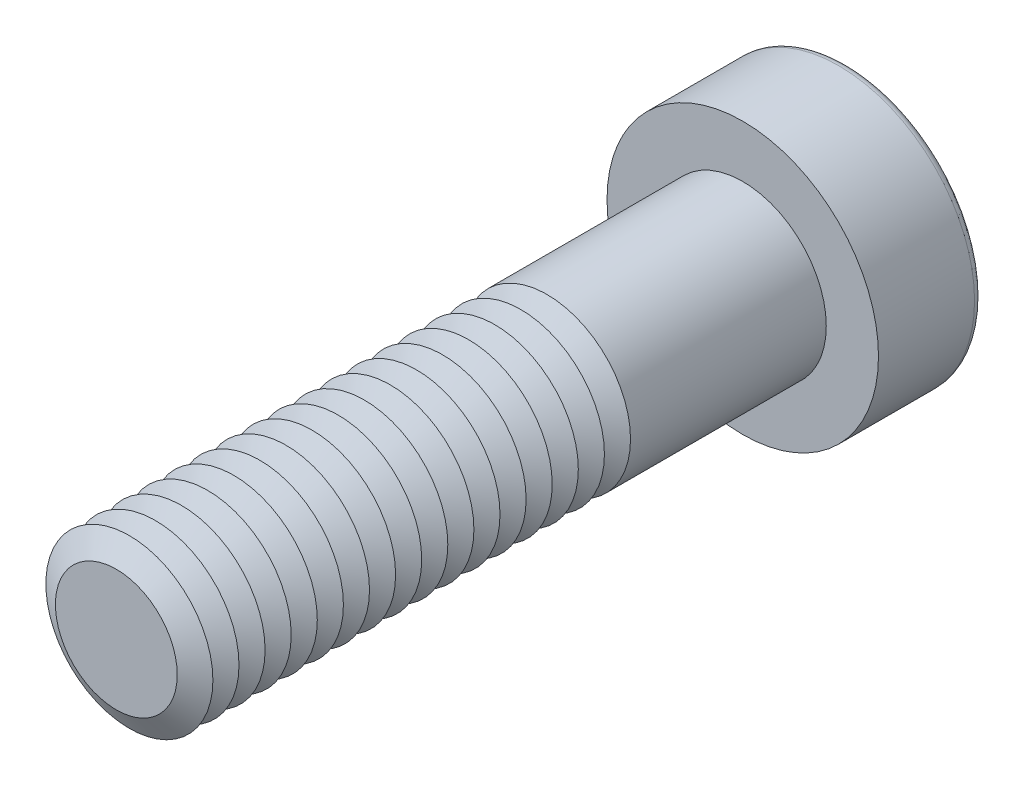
ISO-10303-21;
HEADER;
FILE_DESCRIPTION(('STEP AP214'),'2;1');
FILE_NAME('part.step','',(''),(''),'','','');
FILE_SCHEMA(('AUTOMOTIVE_DESIGN { 1 0 10303 214 1 1 1 1 }'));
ENDSEC;
DATA;
#1=APPLICATION_CONTEXT('core data for automotive mechanical design processes');
#2=APPLICATION_PROTOCOL_DEFINITION('international standard','automotive_design',2000,#1);
#3=PRODUCT_CONTEXT('',#1,'mechanical');
#4=PRODUCT('Part','Part','',(#3));
#5=PRODUCT_RELATED_PRODUCT_CATEGORY('part','',(#4));
#6=PRODUCT_DEFINITION_FORMATION('','',#4);
#7=PRODUCT_DEFINITION_CONTEXT('part definition',#1,'design');
#8=PRODUCT_DEFINITION('design','',#6,#7);
#9=PRODUCT_DEFINITION_SHAPE('','',#8);
#10=(LENGTH_UNIT() NAMED_UNIT(*) SI_UNIT(.MILLI.,.METRE.));
#11=(NAMED_UNIT(*) PLANE_ANGLE_UNIT() SI_UNIT($,.RADIAN.));
#12=(NAMED_UNIT(*) SI_UNIT($,.STERADIAN.) SOLID_ANGLE_UNIT());
#13=UNCERTAINTY_MEASURE_WITH_UNIT(LENGTH_MEASURE(1.E-05),#10,'distance_accuracy_value','');
#14=(GEOMETRIC_REPRESENTATION_CONTEXT(3) GLOBAL_UNCERTAINTY_ASSIGNED_CONTEXT((#13)) GLOBAL_UNIT_ASSIGNED_CONTEXT((#10,
#11,#12)) REPRESENTATION_CONTEXT('',''));
#15=CARTESIAN_POINT('',(0.,0.,0.));
#16=DIRECTION('',(0.,0.,1.));
#17=DIRECTION('',(1.,0.,0.));
#18=AXIS2_PLACEMENT_3D('',#15,#16,#17);
#19=CARTESIAN_POINT('',(0.,0.,25.625));
#20=DIRECTION('',(0.,0.,1.));
#21=DIRECTION('',(1.,0.,0.));
#22=AXIS2_PLACEMENT_3D('',#19,#20,#21);
#23=CONICAL_SURFACE('',#22,4.,1.0471975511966);
#24=CARTESIAN_POINT('',(0.,0.,25.));
#25=DIRECTION('',(0.,0.,1.));
#26=DIRECTION('',(1.,0.,0.));
#27=AXIS2_PLACEMENT_3D('',#24,#25,#26);
#28=CIRCLE('',#27,2.91746824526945);
#29=CARTESIAN_POINT('',(2.91746824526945,0.,25.));
#30=VERTEX_POINT('',#29);
#31=EDGE_CURVE('E312',#30,#30,#28,.T.);
#32=ORIENTED_EDGE('',*,*,#31,.T.);
#33=EDGE_LOOP('',(#32));
#34=FACE_BOUND('',#33,.T.);
#35=CARTESIAN_POINT('',(0.,0.,25.625));
#36=DIRECTION('',(0.,0.,1.));
#37=DIRECTION('',(1.,0.,0.));
#38=AXIS2_PLACEMENT_3D('',#35,#36,#37);
#39=CIRCLE('',#38,4.);
#40=CARTESIAN_POINT('',(4.,0.,25.625));
#41=VERTEX_POINT('',#40);
#42=EDGE_CURVE('E315',#41,#41,#39,.T.);
#43=ORIENTED_EDGE('',*,*,#42,.F.);
#44=EDGE_LOOP('',(#43));
#45=FACE_BOUND('',#44,.T.);
#46=ADVANCED_FACE('F39',(#34,#45),#23,.T.);
#47=CARTESIAN_POINT('',(0.,0.,25.));
#48=DIRECTION('',(0.,0.,-1.));
#49=DIRECTION('',(-1.,0.,0.));
#50=AXIS2_PLACEMENT_3D('',#47,#48,#49);
#51=CONICAL_SURFACE('',#50,2.91746824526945,1.0471975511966);
#52=CARTESIAN_POINT('',(0.,0.,24.375));
#53=DIRECTION('',(0.,0.,1.));
#54=DIRECTION('',(1.,0.,0.));
#55=AXIS2_PLACEMENT_3D('',#52,#53,#54);
#56=CIRCLE('',#55,4.);
#57=CARTESIAN_POINT('',(4.,0.,24.375));
#58=VERTEX_POINT('',#57);
#59=EDGE_CURVE('E323',#58,#58,#56,.T.);
#60=ORIENTED_EDGE('',*,*,#59,.T.);
#61=EDGE_LOOP('',(#60));
#62=FACE_BOUND('',#61,.T.);
#63=ORIENTED_EDGE('',*,*,#31,.F.);
#64=EDGE_LOOP('',(#63));
#65=FACE_BOUND('',#64,.T.);
#66=ADVANCED_FACE('F245',(#62,#65),#51,.T.);
#67=CARTESIAN_POINT('',(0.,0.,30.));
#68=DIRECTION('',(0.,0.,1.));
#69=DIRECTION('',(1.,0.,0.));
#70=AXIS2_PLACEMENT_3D('',#67,#68,#69);
#71=PLANE('',#70);
#72=CARTESIAN_POINT('',(0.,0.,30.));
#73=DIRECTION('',(0.,0.,1.));
#74=DIRECTION('',(1.,0.,0.));
#75=AXIS2_PLACEMENT_3D('',#72,#73,#74);
#76=CIRCLE('',#75,2.91746824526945);
#77=CARTESIAN_POINT('',(2.91746824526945,0.,30.));
#78=VERTEX_POINT('',#77);
#79=EDGE_CURVE('E174',#78,#78,#76,.T.);
#80=ORIENTED_EDGE('',*,*,#79,.T.);
#81=EDGE_LOOP('',(#80));
#82=FACE_BOUND('',#81,.T.);
#83=ADVANCED_FACE('F251',(#82),#71,.T.);
#84=CARTESIAN_POINT('',(0.,0.,30.));
#85=DIRECTION('',(0.,0.,-1.));
#86=DIRECTION('',(-1.,0.,0.));
#87=AXIS2_PLACEMENT_3D('',#84,#85,#86);
#88=CONICAL_SURFACE('',#87,2.91746824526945,1.0471975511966);
#89=CARTESIAN_POINT('',(0.,0.,29.375));
#90=DIRECTION('',(0.,0.,1.));
#91=DIRECTION('',(1.,0.,0.));
#92=AXIS2_PLACEMENT_3D('',#89,#90,#91);
#93=CIRCLE('',#92,4.);
#94=CARTESIAN_POINT('',(4.,0.,29.375));
#95=VERTEX_POINT('',#94);
#96=EDGE_CURVE('E291',#95,#95,#93,.T.);
#97=ORIENTED_EDGE('',*,*,#96,.T.);
#98=EDGE_LOOP('',(#97));
#99=FACE_BOUND('',#98,.T.);
#100=ORIENTED_EDGE('',*,*,#79,.F.);
#101=EDGE_LOOP('',(#100));
#102=FACE_BOUND('',#101,.T.);
#103=ADVANCED_FACE('F199',(#99,#102),#88,.T.);
#104=CARTESIAN_POINT('',(0.,0.,29.375));
#105=DIRECTION('',(0.,0.,1.));
#106=DIRECTION('',(1.,0.,0.));
#107=AXIS2_PLACEMENT_3D('',#104,#105,#106);
#108=CONICAL_SURFACE('',#107,4.,1.0471975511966);
#109=CARTESIAN_POINT('',(0.,0.,28.75));
#110=DIRECTION('',(0.,0.,1.));
#111=DIRECTION('',(1.,0.,0.));
#112=AXIS2_PLACEMENT_3D('',#109,#110,#111);
#113=CIRCLE('',#112,2.91746824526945);
#114=CARTESIAN_POINT('',(2.91746824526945,0.,28.75));
#115=VERTEX_POINT('',#114);
#116=EDGE_CURVE('E288',#115,#115,#113,.T.);
#117=ORIENTED_EDGE('',*,*,#116,.T.);
#118=EDGE_LOOP('',(#117));
#119=FACE_BOUND('',#118,.T.);
#120=ORIENTED_EDGE('',*,*,#96,.F.);
#121=EDGE_LOOP('',(#120));
#122=FACE_BOUND('',#121,.T.);
#123=ADVANCED_FACE('F277',(#119,#122),#108,.T.);
#124=CARTESIAN_POINT('',(0.,0.,28.75));
#125=DIRECTION('',(0.,0.,-1.));
#126=DIRECTION('',(-1.,0.,0.));
#127=AXIS2_PLACEMENT_3D('',#124,#125,#126);
#128=CONICAL_SURFACE('',#127,2.91746824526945,1.0471975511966);
#129=CARTESIAN_POINT('',(0.,0.,28.125));
#130=DIRECTION('',(0.,0.,1.));
#131=DIRECTION('',(1.,0.,0.));
#132=AXIS2_PLACEMENT_3D('',#129,#130,#131);
#133=CIRCLE('',#132,4.);
#134=CARTESIAN_POINT('',(4.,0.,28.125));
#135=VERTEX_POINT('',#134);
#136=EDGE_CURVE('E299',#135,#135,#133,.T.);
#137=ORIENTED_EDGE('',*,*,#136,.T.);
#138=EDGE_LOOP('',(#137));
#139=FACE_BOUND('',#138,.T.);
#140=ORIENTED_EDGE('',*,*,#116,.F.);
#141=EDGE_LOOP('',(#140));
#142=FACE_BOUND('',#141,.T.);
#143=ADVANCED_FACE('F274',(#139,#142),#128,.T.);
#144=CARTESIAN_POINT('',(0.,0.,28.125));
#145=DIRECTION('',(0.,0.,1.));
#146=DIRECTION('',(1.,0.,0.));
#147=AXIS2_PLACEMENT_3D('',#144,#145,#146);
#148=CONICAL_SURFACE('',#147,4.,1.0471975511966);
#149=CARTESIAN_POINT('',(0.,0.,27.5));
#150=DIRECTION('',(0.,0.,1.));
#151=DIRECTION('',(1.,0.,0.));
#152=AXIS2_PLACEMENT_3D('',#149,#150,#151);
#153=CIRCLE('',#152,2.91746824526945);
#154=CARTESIAN_POINT('',(2.91746824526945,0.,27.5));
#155=VERTEX_POINT('',#154);
#156=EDGE_CURVE('E293',#155,#155,#153,.T.);
#157=ORIENTED_EDGE('',*,*,#156,.T.);
#158=EDGE_LOOP('',(#157));
#159=FACE_BOUND('',#158,.T.);
#160=ORIENTED_EDGE('',*,*,#136,.F.);
#161=EDGE_LOOP('',(#160));
#162=FACE_BOUND('',#161,.T.);
#163=ADVANCED_FACE('F270',(#159,#162),#148,.T.);
#164=CARTESIAN_POINT('',(0.,0.,27.5));
#165=DIRECTION('',(0.,0.,-1.));
#166=DIRECTION('',(-1.,0.,0.));
#167=AXIS2_PLACEMENT_3D('',#164,#165,#166);
#168=CONICAL_SURFACE('',#167,2.91746824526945,1.0471975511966);
#169=CARTESIAN_POINT('',(0.,0.,26.875));
#170=DIRECTION('',(0.,0.,1.));
#171=DIRECTION('',(1.,0.,0.));
#172=AXIS2_PLACEMENT_3D('',#169,#170,#171);
#173=CIRCLE('',#172,4.);
#174=CARTESIAN_POINT('',(4.,0.,26.875));
#175=VERTEX_POINT('',#174);
#176=EDGE_CURVE('E309',#175,#175,#173,.T.);
#177=ORIENTED_EDGE('',*,*,#176,.T.);
#178=EDGE_LOOP('',(#177));
#179=FACE_BOUND('',#178,.T.);
#180=ORIENTED_EDGE('',*,*,#156,.F.);
#181=EDGE_LOOP('',(#180));
#182=FACE_BOUND('',#181,.T.);
#183=ADVANCED_FACE('F266',(#179,#182),#168,.T.);
#184=CARTESIAN_POINT('',(0.,0.,26.875));
#185=DIRECTION('',(0.,0.,1.));
#186=DIRECTION('',(1.,0.,0.));
#187=AXIS2_PLACEMENT_3D('',#184,#185,#186);
#188=CONICAL_SURFACE('',#187,4.,1.0471975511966);
#189=CARTESIAN_POINT('',(0.,0.,26.25));
#190=DIRECTION('',(0.,0.,1.));
#191=DIRECTION('',(1.,0.,0.));
#192=AXIS2_PLACEMENT_3D('',#189,#190,#191);
#193=CIRCLE('',#192,2.91746824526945);
#194=CARTESIAN_POINT('',(2.91746824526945,0.,26.25));
#195=VERTEX_POINT('',#194);
#196=EDGE_CURVE('E305',#195,#195,#193,.T.);
#197=ORIENTED_EDGE('',*,*,#196,.T.);
#198=EDGE_LOOP('',(#197));
#199=FACE_BOUND('',#198,.T.);
#200=ORIENTED_EDGE('',*,*,#176,.F.);
#201=EDGE_LOOP('',(#200));
#202=FACE_BOUND('',#201,.T.);
#203=ADVANCED_FACE('F262',(#199,#202),#188,.T.);
#204=CARTESIAN_POINT('',(0.,0.,26.25));
#205=DIRECTION('',(0.,0.,-1.));
#206=DIRECTION('',(-1.,0.,0.));
#207=AXIS2_PLACEMENT_3D('',#204,#205,#206);
#208=CONICAL_SURFACE('',#207,2.91746824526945,1.0471975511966);
#209=ORIENTED_EDGE('',*,*,#42,.T.);
#210=EDGE_LOOP('',(#209));
#211=FACE_BOUND('',#210,.T.);
#212=ORIENTED_EDGE('',*,*,#196,.F.);
#213=EDGE_LOOP('',(#212));
#214=FACE_BOUND('',#213,.T.);
#215=ADVANCED_FACE('F258',(#211,#214),#208,.T.);
#216=CARTESIAN_POINT('',(0.,0.,24.375));
#217=DIRECTION('',(0.,0.,1.));
#218=DIRECTION('',(1.,0.,0.));
#219=AXIS2_PLACEMENT_3D('',#216,#217,#218);
#220=CONICAL_SURFACE('',#219,4.,1.0471975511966);
#221=CARTESIAN_POINT('',(0.,0.,23.75));
#222=DIRECTION('',(0.,0.,1.));
#223=DIRECTION('',(1.,0.,0.));
#224=AXIS2_PLACEMENT_3D('',#221,#222,#223);
#225=CIRCLE('',#224,2.91746824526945);
#226=CARTESIAN_POINT('',(2.91746824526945,0.,23.75));
#227=VERTEX_POINT('',#226);
#228=EDGE_CURVE('E319',#227,#227,#225,.T.);
#229=ORIENTED_EDGE('',*,*,#228,.T.);
#230=EDGE_LOOP('',(#229));
#231=FACE_BOUND('',#230,.T.);
#232=ORIENTED_EDGE('',*,*,#59,.F.);
#233=EDGE_LOOP('',(#232));
#234=FACE_BOUND('',#233,.T.);
#235=ADVANCED_FACE('F261',(#231,#234),#220,.T.);
#236=CARTESIAN_POINT('',(0.,0.,23.75));
#237=DIRECTION('',(0.,0.,-1.));
#238=DIRECTION('',(-1.,0.,0.));
#239=AXIS2_PLACEMENT_3D('',#236,#237,#238);
#240=CONICAL_SURFACE('',#239,2.91746824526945,1.0471975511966);
#241=CARTESIAN_POINT('',(0.,0.,23.125));
#242=DIRECTION('',(0.,0.,1.));
#243=DIRECTION('',(1.,0.,0.));
#244=AXIS2_PLACEMENT_3D('',#241,#242,#243);
#245=CIRCLE('',#244,4.);
#246=CARTESIAN_POINT('',(4.,0.,23.125));
#247=VERTEX_POINT('',#246);
#248=EDGE_CURVE('E331',#247,#247,#245,.T.);
#249=ORIENTED_EDGE('',*,*,#248,.T.);
#250=EDGE_LOOP('',(#249));
#251=FACE_BOUND('',#250,.T.);
#252=ORIENTED_EDGE('',*,*,#228,.F.);
#253=EDGE_LOOP('',(#252));
#254=FACE_BOUND('',#253,.T.);
#255=ADVANCED_FACE('F511',(#251,#254),#240,.T.);
#256=CARTESIAN_POINT('',(0.,0.,23.125));
#257=DIRECTION('',(0.,0.,1.));
#258=DIRECTION('',(1.,0.,0.));
#259=AXIS2_PLACEMENT_3D('',#256,#257,#258);
#260=CONICAL_SURFACE('',#259,4.,1.0471975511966);
#261=CARTESIAN_POINT('',(0.,0.,22.5));
#262=DIRECTION('',(0.,0.,1.));
#263=DIRECTION('',(1.,0.,0.));
#264=AXIS2_PLACEMENT_3D('',#261,#262,#263);
#265=CIRCLE('',#264,2.91746824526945);
#266=CARTESIAN_POINT('',(2.91746824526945,0.,22.5));
#267=VERTEX_POINT('',#266);
#268=EDGE_CURVE('E327',#267,#267,#265,.T.);
#269=ORIENTED_EDGE('',*,*,#268,.T.);
#270=EDGE_LOOP('',(#269));
#271=FACE_BOUND('',#270,.T.);
#272=ORIENTED_EDGE('',*,*,#248,.F.);
#273=EDGE_LOOP('',(#272));
#274=FACE_BOUND('',#273,.T.);
#275=ADVANCED_FACE('F507',(#271,#274),#260,.T.);
#276=CARTESIAN_POINT('',(0.,0.,22.5));
#277=DIRECTION('',(0.,0.,-1.));
#278=DIRECTION('',(-1.,0.,0.));
#279=AXIS2_PLACEMENT_3D('',#276,#277,#278);
#280=CONICAL_SURFACE('',#279,2.91746824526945,1.0471975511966);
#281=CARTESIAN_POINT('',(0.,0.,21.875));
#282=DIRECTION('',(0.,0.,1.));
#283=DIRECTION('',(1.,0.,0.));
#284=AXIS2_PLACEMENT_3D('',#281,#282,#283);
#285=CIRCLE('',#284,4.);
#286=CARTESIAN_POINT('',(4.,0.,21.875));
#287=VERTEX_POINT('',#286);
#288=EDGE_CURVE('E339',#287,#287,#285,.T.);
#289=ORIENTED_EDGE('',*,*,#288,.T.);
#290=EDGE_LOOP('',(#289));
#291=FACE_BOUND('',#290,.T.);
#292=ORIENTED_EDGE('',*,*,#268,.F.);
#293=EDGE_LOOP('',(#292));
#294=FACE_BOUND('',#293,.T.);
#295=ADVANCED_FACE('F503',(#291,#294),#280,.T.);
#296=CARTESIAN_POINT('',(0.,0.,21.875));
#297=DIRECTION('',(0.,0.,1.));
#298=DIRECTION('',(1.,0.,0.));
#299=AXIS2_PLACEMENT_3D('',#296,#297,#298);
#300=CONICAL_SURFACE('',#299,4.,1.0471975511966);
#301=CARTESIAN_POINT('',(0.,0.,21.25));
#302=DIRECTION('',(0.,0.,1.));
#303=DIRECTION('',(1.,0.,0.));
#304=AXIS2_PLACEMENT_3D('',#301,#302,#303);
#305=CIRCLE('',#304,2.91746824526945);
#306=CARTESIAN_POINT('',(2.91746824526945,0.,21.25));
#307=VERTEX_POINT('',#306);
#308=EDGE_CURVE('E335',#307,#307,#305,.T.);
#309=ORIENTED_EDGE('',*,*,#308,.T.);
#310=EDGE_LOOP('',(#309));
#311=FACE_BOUND('',#310,.T.);
#312=ORIENTED_EDGE('',*,*,#288,.F.);
#313=EDGE_LOOP('',(#312));
#314=FACE_BOUND('',#313,.T.);
#315=ADVANCED_FACE('F499',(#311,#314),#300,.T.);
#316=CARTESIAN_POINT('',(0.,0.,21.25));
#317=DIRECTION('',(0.,0.,-1.));
#318=DIRECTION('',(-1.,0.,0.));
#319=AXIS2_PLACEMENT_3D('',#316,#317,#318);
#320=CONICAL_SURFACE('',#319,2.91746824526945,1.0471975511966);
#321=CARTESIAN_POINT('',(0.,0.,20.625));
#322=DIRECTION('',(0.,0.,1.));
#323=DIRECTION('',(1.,0.,0.));
#324=AXIS2_PLACEMENT_3D('',#321,#322,#323);
#325=CIRCLE('',#324,4.);
#326=CARTESIAN_POINT('',(4.,0.,20.625));
#327=VERTEX_POINT('',#326);
#328=EDGE_CURVE('E347',#327,#327,#325,.T.);
#329=ORIENTED_EDGE('',*,*,#328,.T.);
#330=EDGE_LOOP('',(#329));
#331=FACE_BOUND('',#330,.T.);
#332=ORIENTED_EDGE('',*,*,#308,.F.);
#333=EDGE_LOOP('',(#332));
#334=FACE_BOUND('',#333,.T.);
#335=ADVANCED_FACE('F495',(#331,#334),#320,.T.);
#336=CARTESIAN_POINT('',(0.,0.,20.625));
#337=DIRECTION('',(0.,0.,1.));
#338=DIRECTION('',(1.,0.,0.));
#339=AXIS2_PLACEMENT_3D('',#336,#337,#338);
#340=CONICAL_SURFACE('',#339,4.,1.0471975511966);
#341=CARTESIAN_POINT('',(0.,0.,20.));
#342=DIRECTION('',(0.,0.,1.));
#343=DIRECTION('',(1.,0.,0.));
#344=AXIS2_PLACEMENT_3D('',#341,#342,#343);
#345=CIRCLE('',#344,2.91746824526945);
#346=CARTESIAN_POINT('',(2.91746824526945,0.,20.));
#347=VERTEX_POINT('',#346);
#348=EDGE_CURVE('E343',#347,#347,#345,.T.);
#349=ORIENTED_EDGE('',*,*,#348,.T.);
#350=EDGE_LOOP('',(#349));
#351=FACE_BOUND('',#350,.T.);
#352=ORIENTED_EDGE('',*,*,#328,.F.);
#353=EDGE_LOOP('',(#352));
#354=FACE_BOUND('',#353,.T.);
#355=ADVANCED_FACE('F491',(#351,#354),#340,.T.);
#356=CARTESIAN_POINT('',(0.,0.,20.));
#357=DIRECTION('',(0.,0.,-1.));
#358=DIRECTION('',(-1.,0.,0.));
#359=AXIS2_PLACEMENT_3D('',#356,#357,#358);
#360=CONICAL_SURFACE('',#359,2.91746824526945,1.0471975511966);
#361=CARTESIAN_POINT('',(0.,0.,19.375));
#362=DIRECTION('',(0.,0.,1.));
#363=DIRECTION('',(1.,0.,0.));
#364=AXIS2_PLACEMENT_3D('',#361,#362,#363);
#365=CIRCLE('',#364,4.);
#366=CARTESIAN_POINT('',(4.,0.,19.375));
#367=VERTEX_POINT('',#366);
#368=EDGE_CURVE('E355',#367,#367,#365,.T.);
#369=ORIENTED_EDGE('',*,*,#368,.T.);
#370=EDGE_LOOP('',(#369));
#371=FACE_BOUND('',#370,.T.);
#372=ORIENTED_EDGE('',*,*,#348,.F.);
#373=EDGE_LOOP('',(#372));
#374=FACE_BOUND('',#373,.T.);
#375=ADVANCED_FACE('F487',(#371,#374),#360,.T.);
#376=CARTESIAN_POINT('',(0.,0.,19.375));
#377=DIRECTION('',(0.,0.,1.));
#378=DIRECTION('',(1.,0.,0.));
#379=AXIS2_PLACEMENT_3D('',#376,#377,#378);
#380=CONICAL_SURFACE('',#379,4.,1.0471975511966);
#381=CARTESIAN_POINT('',(0.,0.,18.75));
#382=DIRECTION('',(0.,0.,1.));
#383=DIRECTION('',(1.,0.,0.));
#384=AXIS2_PLACEMENT_3D('',#381,#382,#383);
#385=CIRCLE('',#384,2.91746824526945);
#386=CARTESIAN_POINT('',(2.91746824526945,0.,18.75));
#387=VERTEX_POINT('',#386);
#388=EDGE_CURVE('E351',#387,#387,#385,.T.);
#389=ORIENTED_EDGE('',*,*,#388,.T.);
#390=EDGE_LOOP('',(#389));
#391=FACE_BOUND('',#390,.T.);
#392=ORIENTED_EDGE('',*,*,#368,.F.);
#393=EDGE_LOOP('',(#392));
#394=FACE_BOUND('',#393,.T.);
#395=ADVANCED_FACE('F483',(#391,#394),#380,.T.);
#396=CARTESIAN_POINT('',(0.,0.,18.75));
#397=DIRECTION('',(0.,0.,-1.));
#398=DIRECTION('',(-1.,0.,0.));
#399=AXIS2_PLACEMENT_3D('',#396,#397,#398);
#400=CONICAL_SURFACE('',#399,2.91746824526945,1.0471975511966);
#401=CARTESIAN_POINT('',(0.,0.,18.125));
#402=DIRECTION('',(0.,0.,1.));
#403=DIRECTION('',(1.,0.,0.));
#404=AXIS2_PLACEMENT_3D('',#401,#402,#403);
#405=CIRCLE('',#404,4.);
#406=CARTESIAN_POINT('',(4.,0.,18.125));
#407=VERTEX_POINT('',#406);
#408=EDGE_CURVE('E363',#407,#407,#405,.T.);
#409=ORIENTED_EDGE('',*,*,#408,.T.);
#410=EDGE_LOOP('',(#409));
#411=FACE_BOUND('',#410,.T.);
#412=ORIENTED_EDGE('',*,*,#388,.F.);
#413=EDGE_LOOP('',(#412));
#414=FACE_BOUND('',#413,.T.);
#415=ADVANCED_FACE('F479',(#411,#414),#400,.T.);
#416=CARTESIAN_POINT('',(0.,0.,18.125));
#417=DIRECTION('',(0.,0.,1.));
#418=DIRECTION('',(1.,0.,0.));
#419=AXIS2_PLACEMENT_3D('',#416,#417,#418);
#420=CONICAL_SURFACE('',#419,4.,1.0471975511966);
#421=CARTESIAN_POINT('',(0.,0.,17.5));
#422=DIRECTION('',(0.,0.,1.));
#423=DIRECTION('',(1.,0.,0.));
#424=AXIS2_PLACEMENT_3D('',#421,#422,#423);
#425=CIRCLE('',#424,2.91746824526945);
#426=CARTESIAN_POINT('',(2.91746824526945,0.,17.5));
#427=VERTEX_POINT('',#426);
#428=EDGE_CURVE('E359',#427,#427,#425,.T.);
#429=ORIENTED_EDGE('',*,*,#428,.T.);
#430=EDGE_LOOP('',(#429));
#431=FACE_BOUND('',#430,.T.);
#432=ORIENTED_EDGE('',*,*,#408,.F.);
#433=EDGE_LOOP('',(#432));
#434=FACE_BOUND('',#433,.T.);
#435=ADVANCED_FACE('F475',(#431,#434),#420,.T.);
#436=CARTESIAN_POINT('',(0.,0.,17.5));
#437=DIRECTION('',(0.,0.,-1.));
#438=DIRECTION('',(-1.,0.,0.));
#439=AXIS2_PLACEMENT_3D('',#436,#437,#438);
#440=CONICAL_SURFACE('',#439,2.91746824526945,1.0471975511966);
#441=CARTESIAN_POINT('',(0.,0.,16.875));
#442=DIRECTION('',(0.,0.,1.));
#443=DIRECTION('',(1.,0.,0.));
#444=AXIS2_PLACEMENT_3D('',#441,#442,#443);
#445=CIRCLE('',#444,4.);
#446=CARTESIAN_POINT('',(4.,0.,16.875));
#447=VERTEX_POINT('',#446);
#448=EDGE_CURVE('E371',#447,#447,#445,.T.);
#449=ORIENTED_EDGE('',*,*,#448,.T.);
#450=EDGE_LOOP('',(#449));
#451=FACE_BOUND('',#450,.T.);
#452=ORIENTED_EDGE('',*,*,#428,.F.);
#453=EDGE_LOOP('',(#452));
#454=FACE_BOUND('',#453,.T.);
#455=ADVANCED_FACE('F471',(#451,#454),#440,.T.);
#456=CARTESIAN_POINT('',(0.,0.,16.875));
#457=DIRECTION('',(0.,0.,1.));
#458=DIRECTION('',(1.,0.,0.));
#459=AXIS2_PLACEMENT_3D('',#456,#457,#458);
#460=CONICAL_SURFACE('',#459,4.,1.0471975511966);
#461=CARTESIAN_POINT('',(0.,0.,16.25));
#462=DIRECTION('',(0.,0.,1.));
#463=DIRECTION('',(1.,0.,0.));
#464=AXIS2_PLACEMENT_3D('',#461,#462,#463);
#465=CIRCLE('',#464,2.91746824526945);
#466=CARTESIAN_POINT('',(2.91746824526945,0.,16.25));
#467=VERTEX_POINT('',#466);
#468=EDGE_CURVE('E367',#467,#467,#465,.T.);
#469=ORIENTED_EDGE('',*,*,#468,.T.);
#470=EDGE_LOOP('',(#469));
#471=FACE_BOUND('',#470,.T.);
#472=ORIENTED_EDGE('',*,*,#448,.F.);
#473=EDGE_LOOP('',(#472));
#474=FACE_BOUND('',#473,.T.);
#475=ADVANCED_FACE('F467',(#471,#474),#460,.T.);
#476=CARTESIAN_POINT('',(0.,0.,16.25));
#477=DIRECTION('',(0.,0.,-1.));
#478=DIRECTION('',(-1.,0.,0.));
#479=AXIS2_PLACEMENT_3D('',#476,#477,#478);
#480=CONICAL_SURFACE('',#479,2.91746824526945,1.0471975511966);
#481=CARTESIAN_POINT('',(0.,0.,15.625));
#482=DIRECTION('',(0.,0.,1.));
#483=DIRECTION('',(1.,0.,0.));
#484=AXIS2_PLACEMENT_3D('',#481,#482,#483);
#485=CIRCLE('',#484,4.);
#486=CARTESIAN_POINT('',(4.,0.,15.625));
#487=VERTEX_POINT('',#486);
#488=EDGE_CURVE('E379',#487,#487,#485,.T.);
#489=ORIENTED_EDGE('',*,*,#488,.T.);
#490=EDGE_LOOP('',(#489));
#491=FACE_BOUND('',#490,.T.);
#492=ORIENTED_EDGE('',*,*,#468,.F.);
#493=EDGE_LOOP('',(#492));
#494=FACE_BOUND('',#493,.T.);
#495=ADVANCED_FACE('F463',(#491,#494),#480,.T.);
#496=CARTESIAN_POINT('',(0.,0.,15.625));
#497=DIRECTION('',(0.,0.,1.));
#498=DIRECTION('',(1.,0.,0.));
#499=AXIS2_PLACEMENT_3D('',#496,#497,#498);
#500=CONICAL_SURFACE('',#499,4.,1.0471975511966);
#501=CARTESIAN_POINT('',(0.,0.,15.));
#502=DIRECTION('',(0.,0.,1.));
#503=DIRECTION('',(1.,0.,0.));
#504=AXIS2_PLACEMENT_3D('',#501,#502,#503);
#505=CIRCLE('',#504,2.91746824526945);
#506=CARTESIAN_POINT('',(2.91746824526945,0.,15.));
#507=VERTEX_POINT('',#506);
#508=EDGE_CURVE('E375',#507,#507,#505,.T.);
#509=ORIENTED_EDGE('',*,*,#508,.T.);
#510=EDGE_LOOP('',(#509));
#511=FACE_BOUND('',#510,.T.);
#512=ORIENTED_EDGE('',*,*,#488,.F.);
#513=EDGE_LOOP('',(#512));
#514=FACE_BOUND('',#513,.T.);
#515=ADVANCED_FACE('F459',(#511,#514),#500,.T.);
#516=CARTESIAN_POINT('',(0.,0.,15.));
#517=DIRECTION('',(0.,0.,-1.));
#518=DIRECTION('',(-1.,0.,0.));
#519=AXIS2_PLACEMENT_3D('',#516,#517,#518);
#520=CONICAL_SURFACE('',#519,2.91746824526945,1.0471975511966);
#521=CARTESIAN_POINT('',(0.,0.,14.375));
#522=DIRECTION('',(0.,0.,1.));
#523=DIRECTION('',(1.,0.,0.));
#524=AXIS2_PLACEMENT_3D('',#521,#522,#523);
#525=CIRCLE('',#524,4.);
#526=CARTESIAN_POINT('',(4.,0.,14.375));
#527=VERTEX_POINT('',#526);
#528=EDGE_CURVE('E386',#527,#527,#525,.T.);
#529=ORIENTED_EDGE('',*,*,#528,.T.);
#530=EDGE_LOOP('',(#529));
#531=FACE_BOUND('',#530,.T.);
#532=ORIENTED_EDGE('',*,*,#508,.F.);
#533=EDGE_LOOP('',(#532));
#534=FACE_BOUND('',#533,.T.);
#535=ADVANCED_FACE('F455',(#531,#534),#520,.T.);
#536=CARTESIAN_POINT('',(0.,0.,14.375));
#537=DIRECTION('',(0.,0.,1.));
#538=DIRECTION('',(1.,0.,0.));
#539=AXIS2_PLACEMENT_3D('',#536,#537,#538);
#540=CONICAL_SURFACE('',#539,4.,1.0471975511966);
#541=CARTESIAN_POINT('',(0.,0.,13.75));
#542=DIRECTION('',(0.,0.,1.));
#543=DIRECTION('',(1.,0.,0.));
#544=AXIS2_PLACEMENT_3D('',#541,#542,#543);
#545=CIRCLE('',#544,2.91746824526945);
#546=CARTESIAN_POINT('',(2.91746824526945,0.,13.75));
#547=VERTEX_POINT('',#546);
#548=EDGE_CURVE('E383',#547,#547,#545,.T.);
#549=ORIENTED_EDGE('',*,*,#548,.T.);
#550=EDGE_LOOP('',(#549));
#551=FACE_BOUND('',#550,.T.);
#552=ORIENTED_EDGE('',*,*,#528,.F.);
#553=EDGE_LOOP('',(#552));
#554=FACE_BOUND('',#553,.T.);
#555=ADVANCED_FACE('F451',(#551,#554),#540,.T.);
#556=CARTESIAN_POINT('',(0.,0.,13.75));
#557=DIRECTION('',(0.,0.,-1.));
#558=DIRECTION('',(-1.,0.,0.));
#559=AXIS2_PLACEMENT_3D('',#556,#557,#558);
#560=CONICAL_SURFACE('',#559,2.91746824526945,1.0471975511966);
#561=CARTESIAN_POINT('',(0.,0.,13.125));
#562=DIRECTION('',(0.,0.,1.));
#563=DIRECTION('',(1.,0.,0.));
#564=AXIS2_PLACEMENT_3D('',#561,#562,#563);
#565=CIRCLE('',#564,4.);
#566=CARTESIAN_POINT('',(4.,0.,13.125));
#567=VERTEX_POINT('',#566);
#568=EDGE_CURVE('E394',#567,#567,#565,.T.);
#569=ORIENTED_EDGE('',*,*,#568,.T.);
#570=EDGE_LOOP('',(#569));
#571=FACE_BOUND('',#570,.T.);
#572=ORIENTED_EDGE('',*,*,#548,.F.);
#573=EDGE_LOOP('',(#572));
#574=FACE_BOUND('',#573,.T.);
#575=ADVANCED_FACE('F447',(#571,#574),#560,.T.);
#576=CARTESIAN_POINT('',(0.,0.,13.125));
#577=DIRECTION('',(0.,0.,1.));
#578=DIRECTION('',(1.,0.,0.));
#579=AXIS2_PLACEMENT_3D('',#576,#577,#578);
#580=CONICAL_SURFACE('',#579,4.,1.0471975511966);
#581=CARTESIAN_POINT('',(0.,0.,12.5));
#582=DIRECTION('',(0.,0.,1.));
#583=DIRECTION('',(1.,0.,0.));
#584=AXIS2_PLACEMENT_3D('',#581,#582,#583);
#585=CIRCLE('',#584,2.91746824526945);
#586=CARTESIAN_POINT('',(2.91746824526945,0.,12.5));
#587=VERTEX_POINT('',#586);
#588=EDGE_CURVE('E390',#587,#587,#585,.T.);
#589=ORIENTED_EDGE('',*,*,#588,.T.);
#590=EDGE_LOOP('',(#589));
#591=FACE_BOUND('',#590,.T.);
#592=ORIENTED_EDGE('',*,*,#568,.F.);
#593=EDGE_LOOP('',(#592));
#594=FACE_BOUND('',#593,.T.);
#595=ADVANCED_FACE('F443',(#591,#594),#580,.T.);
#596=CARTESIAN_POINT('',(0.,0.,12.5));
#597=DIRECTION('',(0.,0.,-1.));
#598=DIRECTION('',(-1.,0.,0.));
#599=AXIS2_PLACEMENT_3D('',#596,#597,#598);
#600=CONICAL_SURFACE('',#599,2.91746824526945,1.0471975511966);
#601=CARTESIAN_POINT('',(0.,0.,11.875));
#602=DIRECTION('',(0.,0.,1.));
#603=DIRECTION('',(1.,0.,0.));
#604=AXIS2_PLACEMENT_3D('',#601,#602,#603);
#605=CIRCLE('',#604,4.);
#606=CARTESIAN_POINT('',(4.,0.,11.875));
#607=VERTEX_POINT('',#606);
#608=EDGE_CURVE('E402',#607,#607,#605,.T.);
#609=ORIENTED_EDGE('',*,*,#608,.T.);
#610=EDGE_LOOP('',(#609));
#611=FACE_BOUND('',#610,.T.);
#612=ORIENTED_EDGE('',*,*,#588,.F.);
#613=EDGE_LOOP('',(#612));
#614=FACE_BOUND('',#613,.T.);
#615=ADVANCED_FACE('F439',(#611,#614),#600,.T.);
#616=CARTESIAN_POINT('',(0.,0.,11.875));
#617=DIRECTION('',(0.,0.,1.));
#618=DIRECTION('',(1.,0.,0.));
#619=AXIS2_PLACEMENT_3D('',#616,#617,#618);
#620=CONICAL_SURFACE('',#619,4.,1.0471975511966);
#621=CARTESIAN_POINT('',(0.,0.,11.25));
#622=DIRECTION('',(0.,0.,1.));
#623=DIRECTION('',(1.,0.,0.));
#624=AXIS2_PLACEMENT_3D('',#621,#622,#623);
#625=CIRCLE('',#624,2.91746824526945);
#626=CARTESIAN_POINT('',(2.91746824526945,0.,11.25));
#627=VERTEX_POINT('',#626);
#628=EDGE_CURVE('E398',#627,#627,#625,.T.);
#629=ORIENTED_EDGE('',*,*,#628,.T.);
#630=EDGE_LOOP('',(#629));
#631=FACE_BOUND('',#630,.T.);
#632=ORIENTED_EDGE('',*,*,#608,.F.);
#633=EDGE_LOOP('',(#632));
#634=FACE_BOUND('',#633,.T.);
#635=ADVANCED_FACE('F434',(#631,#634),#620,.T.);
#636=CARTESIAN_POINT('',(0.,0.,11.25));
#637=DIRECTION('',(0.,0.,-1.));
#638=DIRECTION('',(-1.,0.,0.));
#639=AXIS2_PLACEMENT_3D('',#636,#637,#638);
#640=CONICAL_SURFACE('',#639,2.91746824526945,1.0471975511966);
#641=CARTESIAN_POINT('',(0.,0.,10.625));
#642=DIRECTION('',(0.,0.,1.));
#643=DIRECTION('',(1.,0.,0.));
#644=AXIS2_PLACEMENT_3D('',#641,#642,#643);
#645=CIRCLE('',#644,4.);
#646=CARTESIAN_POINT('',(4.,0.,10.625));
#647=VERTEX_POINT('',#646);
#648=EDGE_CURVE('E414',#647,#647,#645,.T.);
#649=ORIENTED_EDGE('',*,*,#648,.T.);
#650=EDGE_LOOP('',(#649));
#651=FACE_BOUND('',#650,.T.);
#652=ORIENTED_EDGE('',*,*,#628,.F.);
#653=EDGE_LOOP('',(#652));
#654=FACE_BOUND('',#653,.T.);
#655=ADVANCED_FACE('F420',(#651,#654),#640,.T.);
#656=CARTESIAN_POINT('',(0.,0.,10.625));
#657=DIRECTION('',(0.,0.,1.));
#658=DIRECTION('',(1.,0.,0.));
#659=AXIS2_PLACEMENT_3D('',#656,#657,#658);
#660=CONICAL_SURFACE('',#659,4.,1.0471975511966);
#661=CARTESIAN_POINT('',(0.,0.,10.));
#662=DIRECTION('',(0.,0.,1.));
#663=DIRECTION('',(1.,0.,0.));
#664=AXIS2_PLACEMENT_3D('',#661,#662,#663);
#665=CIRCLE('',#664,2.91746824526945);
#666=CARTESIAN_POINT('',(2.91746824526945,0.,10.));
#667=VERTEX_POINT('',#666);
#668=EDGE_CURVE('E406',#667,#667,#665,.T.);
#669=ORIENTED_EDGE('',*,*,#668,.T.);
#670=EDGE_LOOP('',(#669));
#671=FACE_BOUND('',#670,.T.);
#672=ORIENTED_EDGE('',*,*,#648,.F.);
#673=EDGE_LOOP('',(#672));
#674=FACE_BOUND('',#673,.T.);
#675=ADVANCED_FACE('F423',(#671,#674),#660,.T.);
#676=CARTESIAN_POINT('',(0.,0.,10.));
#677=DIRECTION('',(0.,0.,-1.));
#678=DIRECTION('',(-1.,0.,0.));
#679=AXIS2_PLACEMENT_3D('',#676,#677,#678);
#680=CONICAL_SURFACE('',#679,2.91746824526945,1.0471975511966);
#681=CARTESIAN_POINT('',(0.,0.,9.375));
#682=DIRECTION('',(0.,0.,1.));
#683=DIRECTION('',(1.,0.,0.));
#684=AXIS2_PLACEMENT_3D('',#681,#682,#683);
#685=CIRCLE('',#684,4.);
#686=CARTESIAN_POINT('',(4.,0.,9.375));
#687=VERTEX_POINT('',#686);
#688=EDGE_CURVE('E410',#687,#687,#685,.T.);
#689=ORIENTED_EDGE('',*,*,#688,.T.);
#690=EDGE_LOOP('',(#689));
#691=FACE_BOUND('',#690,.T.);
#692=ORIENTED_EDGE('',*,*,#668,.F.);
#693=EDGE_LOOP('',(#692));
#694=FACE_BOUND('',#693,.T.);
#695=ADVANCED_FACE('F425',(#691,#694),#680,.T.);
#696=CARTESIAN_POINT('',(0.,0.,-1.25));
#697=DIRECTION('',(0.,0.,-1.));
#698=DIRECTION('',(-1.,0.,0.));
#699=AXIS2_PLACEMENT_3D('',#696,#697,#698);
#700=CONICAL_SURFACE('',#699,2.5,1.0471975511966);
#701=CARTESIAN_POINT('',(0.,0.,0.193375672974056));
#702=VERTEX_POINT('',#701);
#703=VERTEX_LOOP('',#702);
#704=FACE_BOUND('',#703,.T.);
#705=CARTESIAN_POINT('',(0.,0.,-1.25));
#706=DIRECTION('',(0.,0.,-1.));
#707=DIRECTION('',(-1.,0.,0.));
#708=AXIS2_PLACEMENT_3D('',#705,#706,#707);
#709=CIRCLE('',#708,2.5);
#710=CARTESIAN_POINT('',(-2.1650635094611,1.25,-1.25));
#711=VERTEX_POINT('',#710);
#712=CARTESIAN_POINT('',(0.,2.5,-1.25));
#713=VERTEX_POINT('',#712);
#714=EDGE_CURVE('E149',#711,#713,#709,.T.);
#715=ORIENTED_EDGE('',*,*,#714,.T.);
#716=CARTESIAN_POINT('',(0.,0.,-1.25));
#717=DIRECTION('',(0.,0.,-1.));
#718=DIRECTION('',(-1.,0.,0.));
#719=AXIS2_PLACEMENT_3D('',#716,#717,#718);
#720=CIRCLE('',#719,2.5);
#721=CARTESIAN_POINT('',(2.1650635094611,1.25,-1.25));
#722=VERTEX_POINT('',#721);
#723=EDGE_CURVE('E54',#713,#722,#720,.T.);
#724=ORIENTED_EDGE('',*,*,#723,.T.);
#725=CARTESIAN_POINT('',(2.1650635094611,-1.25,-1.25));
#726=VERTEX_POINT('',#725);
#727=EDGE_CURVE('E1026',#722,#726,#720,.T.);
#728=ORIENTED_EDGE('',*,*,#727,.T.);
#729=CARTESIAN_POINT('',(0.,-2.5,-1.25));
#730=VERTEX_POINT('',#729);
#731=EDGE_CURVE('E1025',#726,#730,#720,.T.);
#732=ORIENTED_EDGE('',*,*,#731,.T.);
#733=CARTESIAN_POINT('',(-2.1650635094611,-1.25,-1.25));
#734=VERTEX_POINT('',#733);
#735=EDGE_CURVE('E1021',#730,#734,#720,.T.);
#736=ORIENTED_EDGE('',*,*,#735,.T.);
#737=EDGE_CURVE('E1019',#734,#711,#720,.T.);
#738=ORIENTED_EDGE('',*,*,#737,.T.);
#739=EDGE_LOOP('',(#715,#724,#728,#732,#736,#738));
#740=FACE_BOUND('',#739,.T.);
#741=ADVANCED_FACE('F201',(#704,#740),#700,.F.);
#742=CARTESIAN_POINT('',(0.,0.,-1.25));
#743=DIRECTION('',(0.,0.,-1.));
#744=DIRECTION('',(-1.,0.,0.));
#745=AXIS2_PLACEMENT_3D('',#742,#743,#744);
#746=PLANE('',#745);
#747=ORIENTED_EDGE('',*,*,#723,.F.);
#748=DIRECTION('',(1.,0.,0.));
#749=VECTOR('',#748,1.);
#750=CARTESIAN_POINT('',(-1.44337567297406,2.5,-1.25));
#751=LINE('',#750,#749);
#752=CARTESIAN_POINT('',(1.44337567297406,2.5,-1.25));
#753=VERTEX_POINT('',#752);
#754=EDGE_CURVE('E1065',#713,#753,#751,.T.);
#755=ORIENTED_EDGE('',*,*,#754,.T.);
#756=DIRECTION('',(0.5,-0.866025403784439,0.));
#757=VECTOR('',#756,1.);
#758=CARTESIAN_POINT('',(1.44337567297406,2.5,-1.25));
#759=LINE('',#758,#757);
#760=EDGE_CURVE('E155',#753,#722,#759,.T.);
#761=ORIENTED_EDGE('',*,*,#760,.T.);
#762=EDGE_LOOP('',(#747,#755,#761));
#763=FACE_BOUND('',#762,.T.);
#764=ADVANCED_FACE('F606',(#763),#746,.T.);
#765=ORIENTED_EDGE('',*,*,#727,.F.);
#766=CARTESIAN_POINT('',(2.88675134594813,0.,-1.25));
#767=VERTEX_POINT('',#766);
#768=EDGE_CURVE('E1069',#722,#767,#759,.T.);
#769=ORIENTED_EDGE('',*,*,#768,.T.);
#770=DIRECTION('',(-0.5,-0.866025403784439,0.));
#771=VECTOR('',#770,1.);
#772=CARTESIAN_POINT('',(2.88675134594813,0.,-1.25));
#773=LINE('',#772,#771);
#774=EDGE_CURVE('E1040',#767,#726,#773,.T.);
#775=ORIENTED_EDGE('',*,*,#774,.T.);
#776=EDGE_LOOP('',(#765,#769,#775));
#777=FACE_BOUND('',#776,.T.);
#778=ADVANCED_FACE('F616',(#777),#746,.T.);
#779=ORIENTED_EDGE('',*,*,#731,.F.);
#780=CARTESIAN_POINT('',(1.44337567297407,-2.5,-1.25));
#781=VERTEX_POINT('',#780);
#782=EDGE_CURVE('E1042',#726,#781,#773,.T.);
#783=ORIENTED_EDGE('',*,*,#782,.T.);
#784=DIRECTION('',(-1.,0.,0.));
#785=VECTOR('',#784,1.);
#786=CARTESIAN_POINT('',(1.44337567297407,-2.5,-1.25));
#787=LINE('',#786,#785);
#788=EDGE_CURVE('E993',#781,#730,#787,.T.);
#789=ORIENTED_EDGE('',*,*,#788,.T.);
#790=EDGE_LOOP('',(#779,#783,#789));
#791=FACE_BOUND('',#790,.T.);
#792=ADVANCED_FACE('F626',(#791),#746,.T.);
#793=ORIENTED_EDGE('',*,*,#735,.F.);
#794=CARTESIAN_POINT('',(-1.44337567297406,-2.5,-1.25));
#795=VERTEX_POINT('',#794);
#796=EDGE_CURVE('E1036',#730,#795,#787,.T.);
#797=ORIENTED_EDGE('',*,*,#796,.T.);
#798=DIRECTION('',(-0.5,0.866025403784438,0.));
#799=VECTOR('',#798,1.);
#800=CARTESIAN_POINT('',(-1.44337567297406,-2.5,-1.25));
#801=LINE('',#800,#799);
#802=EDGE_CURVE('E1038',#795,#734,#801,.T.);
#803=ORIENTED_EDGE('',*,*,#802,.T.);
#804=EDGE_LOOP('',(#793,#797,#803));
#805=FACE_BOUND('',#804,.T.);
#806=ADVANCED_FACE('F634',(#805),#746,.T.);
#807=ORIENTED_EDGE('',*,*,#737,.F.);
#808=CARTESIAN_POINT('',(-2.88675134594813,0.,-1.25));
#809=VERTEX_POINT('',#808);
#810=EDGE_CURVE('E1043',#734,#809,#801,.T.);
#811=ORIENTED_EDGE('',*,*,#810,.T.);
#812=DIRECTION('',(0.5,0.866025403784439,0.));
#813=VECTOR('',#812,1.);
#814=CARTESIAN_POINT('',(-2.88675134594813,0.,-1.25));
#815=LINE('',#814,#813);
#816=EDGE_CURVE('E158',#809,#711,#815,.T.);
#817=ORIENTED_EDGE('',*,*,#816,.T.);
#818=EDGE_LOOP('',(#807,#811,#817));
#819=FACE_BOUND('',#818,.T.);
#820=ADVANCED_FACE('F231',(#819),#746,.T.);
#821=ORIENTED_EDGE('',*,*,#714,.F.);
#822=CARTESIAN_POINT('',(-1.44337567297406,2.5,-1.25));
#823=VERTEX_POINT('',#822);
#824=EDGE_CURVE('E1050',#711,#823,#815,.T.);
#825=ORIENTED_EDGE('',*,*,#824,.T.);
#826=EDGE_CURVE('E1063',#823,#713,#751,.T.);
#827=ORIENTED_EDGE('',*,*,#826,.T.);
#828=EDGE_LOOP('',(#821,#825,#827));
#829=FACE_BOUND('',#828,.T.);
#830=ADVANCED_FACE('F618',(#829),#746,.T.);
#831=CARTESIAN_POINT('',(-1.44337567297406,2.5,-1.25));
#832=DIRECTION('',(0.,1.,0.));
#833=DIRECTION('',(-1.,0.,0.));
#834=AXIS2_PLACEMENT_3D('',#831,#832,#833);
#835=PLANE('',#834);
#836=DIRECTION('',(0.,0.,-1.));
#837=VECTOR('',#836,1.);
#838=CARTESIAN_POINT('',(-1.44337567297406,2.5,-1.25));
#839=LINE('',#838,#837);
#840=CARTESIAN_POINT('',(-1.44337567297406,2.5,-5.));
#841=VERTEX_POINT('',#840);
#842=EDGE_CURVE('E147',#823,#841,#839,.T.);
#843=ORIENTED_EDGE('',*,*,#842,.T.);
#844=CARTESIAN_POINT('',(-3.76800948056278,2.5,-5.43814611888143));
#845=CARTESIAN_POINT('',(-3.65512241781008,2.5,-5.41294788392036));
#846=CARTESIAN_POINT('',(-3.54216337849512,2.5,-5.38806689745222));
#847=CARTESIAN_POINT('',(-3.31606595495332,2.5,-5.33910944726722));
#848=CARTESIAN_POINT('',(-3.202927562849,2.5,-5.31503301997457));
#849=CARTESIAN_POINT('',(-2.97632910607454,2.5,-5.26783262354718));
#850=CARTESIAN_POINT('',(-2.86286882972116,2.5,-5.24470966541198));
#851=CARTESIAN_POINT('',(-2.63570880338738,2.5,-5.19967851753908));
#852=CARTESIAN_POINT('',(-2.522009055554,2.5,-5.17777031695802));
#853=CARTESIAN_POINT('',(-2.18246936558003,2.5,-5.11464083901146));
#854=CARTESIAN_POINT('',(-1.95621666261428,2.5,-5.07559469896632));
#855=CARTESIAN_POINT('',(-1.50233128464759,2.5,-5.00642421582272));
#856=CARTESIAN_POINT('',(-1.27469889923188,2.5,-4.97629806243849));
#857=CARTESIAN_POINT('',(-0.930935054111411,2.5,-4.9407375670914));
#858=CARTESIAN_POINT('',(-0.815306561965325,2.5,-4.93045885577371));
#859=CARTESIAN_POINT('',(-0.583775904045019,2.5,-4.91374261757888));
#860=CARTESIAN_POINT('',(-0.467873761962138,2.5,-4.9073047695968));
#861=CARTESIAN_POINT('',(-0.235955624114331,2.5,-4.89864425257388));
#862=CARTESIAN_POINT('',(-0.119939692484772,2.5,-4.89641989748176));
#863=CARTESIAN_POINT('',(0.11209426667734,2.5,-4.89632233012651));
#864=CARTESIAN_POINT('',(0.228112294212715,2.5,-4.89844912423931));
#865=CARTESIAN_POINT('',(0.460464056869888,2.5,-4.90693624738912));
#866=CARTESIAN_POINT('',(0.576797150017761,2.5,-4.91331380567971));
#867=CARTESIAN_POINT('',(0.809186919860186,2.5,-4.92994602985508));
#868=CARTESIAN_POINT('',(0.925243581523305,2.5,-4.94020090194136));
#869=CARTESIAN_POINT('',(1.1570783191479,2.5,-4.96408095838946));
#870=CARTESIAN_POINT('',(1.27285617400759,2.5,-4.97770825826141));
#871=CARTESIAN_POINT('',(1.50403978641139,2.5,-5.0077859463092));
#872=CARTESIAN_POINT('',(1.61944554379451,2.5,-5.02423633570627));
#873=CARTESIAN_POINT('',(1.97116037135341,2.5,-5.07794848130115));
#874=CARTESIAN_POINT('',(2.20690405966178,2.5,-5.11889404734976));
#875=CARTESIAN_POINT('',(2.67723558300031,2.5,-5.2069642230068));
#876=CARTESIAN_POINT('',(2.9118232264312,2.5,-5.25408982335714));
#877=CARTESIAN_POINT('',(3.38022088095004,2.5,-5.35235327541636));
#878=CARTESIAN_POINT('',(3.61403064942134,2.5,-5.40349227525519));
#879=CARTESIAN_POINT('',(4.08105387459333,2.5,-5.50842823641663));
#880=CARTESIAN_POINT('',(4.31426731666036,2.5,-5.56222526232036));
#881=CARTESIAN_POINT('',(4.77742011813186,2.5,-5.67097662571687));
#882=CARTESIAN_POINT('',(5.00736469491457,2.5,-5.72590882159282));
#883=CARTESIAN_POINT('',(5.46695141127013,2.5,-5.83704335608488));
#884=CARTESIAN_POINT('',(5.69659354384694,2.5,-5.89324572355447));
#885=CARTESIAN_POINT('',(6.15532898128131,2.5,-6.00649703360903));
#886=CARTESIAN_POINT('',(6.3844226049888,2.5,-6.06354468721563));
#887=CARTESIAN_POINT('',(6.84242442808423,2.5,-6.17834514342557));
#888=CARTESIAN_POINT('',(7.07133263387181,2.5,-6.23609792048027));
#889=CARTESIAN_POINT('',(7.30017784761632,2.5,-6.29409642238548));
#890=B_SPLINE_CURVE_WITH_KNOTS('',3,(#844,#845,#846,#847,#848,#849,#850,#851,#852,#853,#854,
#855,#856,#857,#858,#859,#860,#861,#862,#863,#864,#865,#866,#867,#868,#869,#870,#871,#872,#873,
#874,#875,#876,#877,#878,#879,#880,#881,#882,#883,#884,#885,#886,#887,#888,#889),.UNSPECIFIED.,
.F.,.F.,(4,2,2,2,2,2,2,2,2,2,2,2,2,2,2,2,2,2,2,2,2,2,4),(0.,0.346996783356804,0.694009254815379,
1.04138068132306,1.38874900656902,2.07743762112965,2.76598637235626,3.11418615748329,
3.46235682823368,3.81038814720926,4.15841997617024,4.50787110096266,4.85734081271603,
5.2070303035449,5.55671994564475,6.27438533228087,6.99216591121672,7.71015258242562,
8.42815670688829,9.13739674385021,9.84665290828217,10.5549206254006,11.2631627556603),.UNSPECIFIED.);
#891=CARTESIAN_POINT('',(1.44337567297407,2.5,-5.));
#892=VERTEX_POINT('',#891);
#893=EDGE_CURVE('E124',#841,#892,#890,.T.);
#894=ORIENTED_EDGE('',*,*,#893,.T.);
#895=DIRECTION('',(0.,0.,-1.));
#896=VECTOR('',#895,1.);
#897=CARTESIAN_POINT('',(1.44337567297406,2.5,-1.25));
#898=LINE('',#897,#896);
#899=EDGE_CURVE('E143',#753,#892,#898,.T.);
#900=ORIENTED_EDGE('',*,*,#899,.F.);
#901=ORIENTED_EDGE('',*,*,#754,.F.);
#902=ORIENTED_EDGE('',*,*,#826,.F.);
#903=EDGE_LOOP('',(#843,#894,#900,#901,#902));
#904=FACE_BOUND('',#903,.T.);
#905=ADVANCED_FACE('F141',(#904),#835,.F.);
#906=CARTESIAN_POINT('',(1.44337567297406,2.5,-1.25));
#907=DIRECTION('',(0.866025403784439,0.5,0.));
#908=DIRECTION('',(-0.5,0.866025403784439,0.));
#909=AXIS2_PLACEMENT_3D('',#906,#907,#908);
#910=PLANE('',#909);
#911=ORIENTED_EDGE('',*,*,#899,.T.);
#912=CARTESIAN_POINT('',(1.44326020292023,2.5002,-5.00003094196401));
#913=CARTESIAN_POINT('',(1.50320952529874,2.3963647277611,-4.98395956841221));
#914=CARTESIAN_POINT('',(1.56326755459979,2.29234116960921,-4.96936932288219));
#915=CARTESIAN_POINT('',(1.68359574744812,2.08392662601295,-4.94373552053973));
#916=CARTESIAN_POINT('',(1.7438659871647,1.97953550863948,-4.93269340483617));
#917=CARTESIAN_POINT('',(1.86425311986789,1.77101887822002,-4.91480059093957));
#918=CARTESIAN_POINT('',(1.9243691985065,1.66689477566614,-4.90792855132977));
#919=CARTESIAN_POINT('',(2.04467803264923,1.45851376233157,-4.89871383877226));
#920=CARTESIAN_POINT('',(2.10487077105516,1.35425688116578,-4.89637028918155));
#921=CARTESIAN_POINT('',(2.22525624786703,1.14574311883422,-4.89637028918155));
#922=CARTESIAN_POINT('',(2.28544898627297,1.04148623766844,-4.89871383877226));
#923=CARTESIAN_POINT('',(2.40575782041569,0.833105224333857,-4.90792855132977));
#924=CARTESIAN_POINT('',(2.4658738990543,0.728981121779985,-4.91480059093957));
#925=CARTESIAN_POINT('',(2.58626103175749,0.520464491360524,-4.93269340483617));
#926=CARTESIAN_POINT('',(2.64653127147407,0.416073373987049,-4.94373552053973));
#927=CARTESIAN_POINT('',(2.7668594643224,0.207658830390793,-4.96936932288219));
#928=CARTESIAN_POINT('',(2.82691749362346,0.103635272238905,-4.98395956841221));
#929=CARTESIAN_POINT('',(2.88686681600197,-0.000199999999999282,-5.00003094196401));
#930=B_SPLINE_CURVE_WITH_KNOTS('',3,(#912,#913,#914,#915,#916,#917,#918,#919,#920,#921,#922,
#923,#924,#925,#926,#927,#928,#929),.UNSPECIFIED.,.F.,.F.,(4,2,2,2,2,2,2,2,4),(0.,
0.362931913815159,0.726011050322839,1.08721601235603,1.44835104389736,1.80948607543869,
2.17069103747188,2.53377017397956,2.89670208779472),.UNSPECIFIED.);
#931=CARTESIAN_POINT('',(2.88675134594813,0.,-5.));
#932=VERTEX_POINT('',#931);
#933=EDGE_CURVE('E11',#892,#932,#930,.T.);
#934=ORIENTED_EDGE('',*,*,#933,.T.);
#935=DIRECTION('',(0.,0.,-1.));
#936=VECTOR('',#935,1.);
#937=CARTESIAN_POINT('',(2.88675134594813,0.,-1.25));
#938=LINE('',#937,#936);
#939=EDGE_CURVE('E157',#767,#932,#938,.T.);
#940=ORIENTED_EDGE('',*,*,#939,.F.);
#941=ORIENTED_EDGE('',*,*,#768,.F.);
#942=ORIENTED_EDGE('',*,*,#760,.F.);
#943=EDGE_LOOP('',(#911,#934,#940,#941,#942));
#944=FACE_BOUND('',#943,.T.);
#945=ADVANCED_FACE('F152',(#944),#910,.F.);
#946=CARTESIAN_POINT('',(2.88675134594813,0.,-1.25));
#947=DIRECTION('',(0.866025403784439,-0.5,0.));
#948=DIRECTION('',(0.5,0.866025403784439,0.));
#949=AXIS2_PLACEMENT_3D('',#946,#947,#948);
#950=PLANE('',#949);
#951=ORIENTED_EDGE('',*,*,#939,.T.);
#952=CARTESIAN_POINT('',(2.88686681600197,0.000200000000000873,-5.00003094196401));
#953=CARTESIAN_POINT('',(2.82691749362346,-0.103635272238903,-4.98395956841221));
#954=CARTESIAN_POINT('',(2.7668594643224,-0.207658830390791,-4.96936932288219));
#955=CARTESIAN_POINT('',(2.64653127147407,-0.416073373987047,-4.94373552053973));
#956=CARTESIAN_POINT('',(2.58626103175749,-0.520464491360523,-4.93269340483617));
#957=CARTESIAN_POINT('',(2.4658738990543,-0.728981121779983,-4.91480059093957));
#958=CARTESIAN_POINT('',(2.40575782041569,-0.833105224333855,-4.90792855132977));
#959=CARTESIAN_POINT('',(2.28544898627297,-1.04148623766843,-4.89871383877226));
#960=CARTESIAN_POINT('',(2.22525624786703,-1.14574311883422,-4.89637028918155));
#961=CARTESIAN_POINT('',(2.10487077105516,-1.35425688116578,-4.89637028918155));
#962=CARTESIAN_POINT('',(2.04467803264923,-1.45851376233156,-4.89871383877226));
#963=CARTESIAN_POINT('',(1.9243691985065,-1.66689477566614,-4.90792855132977));
#964=CARTESIAN_POINT('',(1.86425311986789,-1.77101887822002,-4.91480059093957));
#965=CARTESIAN_POINT('',(1.74386598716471,-1.97953550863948,-4.93269340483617));
#966=CARTESIAN_POINT('',(1.68359574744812,-2.08392662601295,-4.94373552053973));
#967=CARTESIAN_POINT('',(1.56326755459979,-2.29234116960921,-4.96936932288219));
#968=CARTESIAN_POINT('',(1.50320952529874,-2.3963647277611,-4.98395956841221));
#969=CARTESIAN_POINT('',(1.44326020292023,-2.5002,-5.00003094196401));
#970=B_SPLINE_CURVE_WITH_KNOTS('',3,(#952,#953,#954,#955,#956,#957,#958,#959,#960,#961,#962,
#963,#964,#965,#966,#967,#968,#969),.UNSPECIFIED.,.F.,.F.,(4,2,2,2,2,2,2,2,4),(0.,
0.362931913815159,0.726011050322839,1.08721601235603,1.44835104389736,1.80948607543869,
2.17069103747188,2.53377017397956,2.89670208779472),.UNSPECIFIED.);
#971=CARTESIAN_POINT('',(1.44337567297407,-2.5,-5.));
#972=VERTEX_POINT('',#971);
#973=EDGE_CURVE('E173',#932,#972,#970,.T.);
#974=ORIENTED_EDGE('',*,*,#973,.T.);
#975=DIRECTION('',(0.,0.,-1.));
#976=VECTOR('',#975,1.);
#977=CARTESIAN_POINT('',(1.44337567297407,-2.5,-1.25));
#978=LINE('',#977,#976);
#979=EDGE_CURVE('E988',#781,#972,#978,.T.);
#980=ORIENTED_EDGE('',*,*,#979,.F.);
#981=ORIENTED_EDGE('',*,*,#782,.F.);
#982=ORIENTED_EDGE('',*,*,#774,.F.);
#983=EDGE_LOOP('',(#951,#974,#980,#981,#982));
#984=FACE_BOUND('',#983,.T.);
#985=ADVANCED_FACE('F191',(#984),#950,.F.);
#986=CARTESIAN_POINT('',(1.44337567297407,-2.5,-1.25));
#987=DIRECTION('',(0.,-1.,0.));
#988=DIRECTION('',(1.,0.,0.));
#989=AXIS2_PLACEMENT_3D('',#986,#987,#988);
#990=PLANE('',#989);
#991=ORIENTED_EDGE('',*,*,#979,.T.);
#992=CARTESIAN_POINT('',(-3.76800948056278,-2.5,-5.43814611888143));
#993=CARTESIAN_POINT('',(-3.65512241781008,-2.5,-5.41294788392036));
#994=CARTESIAN_POINT('',(-3.54216337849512,-2.5,-5.38806689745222));
#995=CARTESIAN_POINT('',(-3.31606595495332,-2.5,-5.33910944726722));
#996=CARTESIAN_POINT('',(-3.202927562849,-2.5,-5.31503301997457));
#997=CARTESIAN_POINT('',(-2.97632910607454,-2.5,-5.26783262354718));
#998=CARTESIAN_POINT('',(-2.86286882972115,-2.5,-5.24470966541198));
#999=CARTESIAN_POINT('',(-2.63570880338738,-2.5,-5.19967851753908));
#1000=CARTESIAN_POINT('',(-2.522009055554,-2.5,-5.17777031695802));
#1001=CARTESIAN_POINT('',(-2.18246936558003,-2.5,-5.11464083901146));
#1002=CARTESIAN_POINT('',(-1.95621666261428,-2.5,-5.07559469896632));
#1003=CARTESIAN_POINT('',(-1.50233128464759,-2.5,-5.00642421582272));
#1004=CARTESIAN_POINT('',(-1.27469889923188,-2.5,-4.97629806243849));
#1005=CARTESIAN_POINT('',(-0.930935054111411,-2.5,-4.9407375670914));
#1006=CARTESIAN_POINT('',(-0.815306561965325,-2.5,-4.93045885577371));
#1007=CARTESIAN_POINT('',(-0.583775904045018,-2.5,-4.91374261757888));
#1008=CARTESIAN_POINT('',(-0.467873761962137,-2.5,-4.9073047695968));
#1009=CARTESIAN_POINT('',(-0.23595562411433,-2.5,-4.89864425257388));
#1010=CARTESIAN_POINT('',(-0.119939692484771,-2.5,-4.89641989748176));
#1011=CARTESIAN_POINT('',(0.112094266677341,-2.5,-4.89632233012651));
#1012=CARTESIAN_POINT('',(0.228112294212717,-2.5,-4.89844912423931));
#1013=CARTESIAN_POINT('',(0.460464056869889,-2.5,-4.90693624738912));
#1014=CARTESIAN_POINT('',(0.576797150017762,-2.5,-4.91331380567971));
#1015=CARTESIAN_POINT('',(0.809186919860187,-2.5,-4.92994602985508));
#1016=CARTESIAN_POINT('',(0.925243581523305,-2.5,-4.94020090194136));
#1017=CARTESIAN_POINT('',(1.1570783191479,-2.5,-4.96408095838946));
#1018=CARTESIAN_POINT('',(1.27285617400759,-2.5,-4.97770825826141));
#1019=CARTESIAN_POINT('',(1.50403978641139,-2.5,-5.0077859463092));
#1020=CARTESIAN_POINT('',(1.61944554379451,-2.5,-5.02423633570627));
#1021=CARTESIAN_POINT('',(1.97116037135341,-2.5,-5.07794848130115));
#1022=CARTESIAN_POINT('',(2.20690405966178,-2.5,-5.11889404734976));
#1023=CARTESIAN_POINT('',(2.67723558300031,-2.5,-5.2069642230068));
#1024=CARTESIAN_POINT('',(2.9118232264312,-2.5,-5.25408982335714));
#1025=CARTESIAN_POINT('',(3.38022088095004,-2.5,-5.35235327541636));
#1026=CARTESIAN_POINT('',(3.61403064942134,-2.5,-5.40349227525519));
#1027=CARTESIAN_POINT('',(4.08105387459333,-2.5,-5.50842823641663));
#1028=CARTESIAN_POINT('',(4.31426731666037,-2.5,-5.56222526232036));
#1029=CARTESIAN_POINT('',(4.77742011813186,-2.5,-5.67097662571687));
#1030=CARTESIAN_POINT('',(5.00736469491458,-2.5,-5.72590882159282));
#1031=CARTESIAN_POINT('',(5.46695141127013,-2.5,-5.83704335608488));
#1032=CARTESIAN_POINT('',(5.69659354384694,-2.5,-5.89324572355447));
#1033=CARTESIAN_POINT('',(6.15532898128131,-2.5,-6.00649703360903));
#1034=CARTESIAN_POINT('',(6.38442260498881,-2.5,-6.06354468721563));
#1035=CARTESIAN_POINT('',(6.84242442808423,-2.5,-6.17834514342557));
#1036=CARTESIAN_POINT('',(7.07133263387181,-2.5,-6.23609792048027));
#1037=CARTESIAN_POINT('',(7.30017784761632,-2.5,-6.29409642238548));
#1038=B_SPLINE_CURVE_WITH_KNOTS('',3,(#992,#993,#994,#995,#996,#997,#998,#999,#1000,#1001,#1002,
#1003,#1004,#1005,#1006,#1007,#1008,#1009,#1010,#1011,#1012,#1013,#1014,#1015,#1016,#1017,#1018,
#1019,#1020,#1021,#1022,#1023,#1024,#1025,#1026,#1027,#1028,#1029,#1030,#1031,#1032,#1033,#1034,
#1035,#1036,#1037),.UNSPECIFIED.,.F.,.F.,(4,2,2,2,2,2,2,2,2,2,2,2,2,2,2,2,2,2,2,2,2,2,4),(0.,
0.346996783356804,0.69400925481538,1.04138068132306,1.38874900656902,2.07743762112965,
2.76598637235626,3.11418615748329,3.46235682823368,3.81038814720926,4.15841997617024,
4.50787110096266,4.85734081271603,5.20703030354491,5.55671994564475,6.27438533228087,
6.99216591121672,7.71015258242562,8.42815670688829,9.13739674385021,9.84665290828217,
10.5549206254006,11.2631627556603),.UNSPECIFIED.);
#1039=CARTESIAN_POINT('',(-1.44337567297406,-2.5,-5.));
#1040=VERTEX_POINT('',#1039);
#1041=EDGE_CURVE('E184',#972,#1040,#1038,.F.);
#1042=ORIENTED_EDGE('',*,*,#1041,.T.);
#1043=DIRECTION('',(0.,0.,-1.));
#1044=VECTOR('',#1043,1.);
#1045=CARTESIAN_POINT('',(-1.44337567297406,-2.5,-1.25));
#1046=LINE('',#1045,#1044);
#1047=EDGE_CURVE('E995',#795,#1040,#1046,.T.);
#1048=ORIENTED_EDGE('',*,*,#1047,.F.);
#1049=ORIENTED_EDGE('',*,*,#796,.F.);
#1050=ORIENTED_EDGE('',*,*,#788,.F.);
#1051=EDGE_LOOP('',(#991,#1042,#1048,#1049,#1050));
#1052=FACE_BOUND('',#1051,.T.);
#1053=ADVANCED_FACE('F234',(#1052),#990,.F.);
#1054=CARTESIAN_POINT('',(-1.44337567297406,-2.5,-1.25));
#1055=DIRECTION('',(-0.866025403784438,-0.5,0.));
#1056=DIRECTION('',(0.5,-0.866025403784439,0.));
#1057=AXIS2_PLACEMENT_3D('',#1054,#1055,#1056);
#1058=PLANE('',#1057);
#1059=ORIENTED_EDGE('',*,*,#1047,.T.);
#1060=CARTESIAN_POINT('',(-1.44326020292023,-2.5002,-5.00003094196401));
#1061=CARTESIAN_POINT('',(-1.50320952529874,-2.3963647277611,-4.98395956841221));
#1062=CARTESIAN_POINT('',(-1.56326755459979,-2.29234116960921,-4.96936932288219));
#1063=CARTESIAN_POINT('',(-1.68359574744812,-2.08392662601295,-4.94373552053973));
#1064=CARTESIAN_POINT('',(-1.7438659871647,-1.97953550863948,-4.93269340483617));
#1065=CARTESIAN_POINT('',(-1.86425311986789,-1.77101887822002,-4.91480059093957));
#1066=CARTESIAN_POINT('',(-1.9243691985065,-1.66689477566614,-4.90792855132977));
#1067=CARTESIAN_POINT('',(-2.04467803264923,-1.45851376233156,-4.89871383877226));
#1068=CARTESIAN_POINT('',(-2.10487077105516,-1.35425688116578,-4.89637028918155));
#1069=CARTESIAN_POINT('',(-2.22525624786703,-1.14574311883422,-4.89637028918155));
#1070=CARTESIAN_POINT('',(-2.28544898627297,-1.04148623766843,-4.89871383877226));
#1071=CARTESIAN_POINT('',(-2.40575782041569,-0.833105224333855,-4.90792855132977));
#1072=CARTESIAN_POINT('',(-2.4658738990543,-0.728981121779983,-4.91480059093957));
#1073=CARTESIAN_POINT('',(-2.58626103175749,-0.520464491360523,-4.93269340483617));
#1074=CARTESIAN_POINT('',(-2.64653127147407,-0.416073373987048,-4.94373552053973));
#1075=CARTESIAN_POINT('',(-2.7668594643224,-0.207658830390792,-4.96936932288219));
#1076=CARTESIAN_POINT('',(-2.82691749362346,-0.103635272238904,-4.98395956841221));
#1077=CARTESIAN_POINT('',(-2.88686681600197,0.000199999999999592,-5.00003094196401));
#1078=B_SPLINE_CURVE_WITH_KNOTS('',3,(#1060,#1061,#1062,#1063,#1064,#1065,#1066,#1067,#1068,
#1069,#1070,#1071,#1072,#1073,#1074,#1075,#1076,#1077),.UNSPECIFIED.,.F.,.F.,(4,2,2,2,2,2,2,2,
4),(0.,0.362931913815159,0.726011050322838,1.08721601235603,1.44835104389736,1.80948607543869,
2.17069103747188,2.53377017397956,2.89670208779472),.UNSPECIFIED.);
#1079=CARTESIAN_POINT('',(-2.88675134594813,0.,-5.));
#1080=VERTEX_POINT('',#1079);
#1081=EDGE_CURVE('E208',#1040,#1080,#1078,.T.);
#1082=ORIENTED_EDGE('',*,*,#1081,.T.);
#1083=DIRECTION('',(0.,0.,-1.));
#1084=VECTOR('',#1083,1.);
#1085=CARTESIAN_POINT('',(-2.88675134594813,0.,-1.25));
#1086=LINE('',#1085,#1084);
#1087=EDGE_CURVE('E999',#809,#1080,#1086,.T.);
#1088=ORIENTED_EDGE('',*,*,#1087,.F.);
#1089=ORIENTED_EDGE('',*,*,#810,.F.);
#1090=ORIENTED_EDGE('',*,*,#802,.F.);
#1091=EDGE_LOOP('',(#1059,#1082,#1088,#1089,#1090));
#1092=FACE_BOUND('',#1091,.T.);
#1093=ADVANCED_FACE('F229',(#1092),#1058,.F.);
#1094=CARTESIAN_POINT('',(-2.88675134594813,0.,-1.25));
#1095=DIRECTION('',(-0.866025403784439,0.5,0.));
#1096=DIRECTION('',(-0.5,-0.866025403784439,0.));
#1097=AXIS2_PLACEMENT_3D('',#1094,#1095,#1096);
#1098=PLANE('',#1097);
#1099=ORIENTED_EDGE('',*,*,#1087,.T.);
#1100=CARTESIAN_POINT('',(-2.88686681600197,-0.000200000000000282,-5.00003094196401));
#1101=CARTESIAN_POINT('',(-2.82691749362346,0.103635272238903,-4.98395956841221));
#1102=CARTESIAN_POINT('',(-2.7668594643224,0.207658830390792,-4.96936932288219));
#1103=CARTESIAN_POINT('',(-2.64653127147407,0.416073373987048,-4.94373552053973));
#1104=CARTESIAN_POINT('',(-2.58626103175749,0.520464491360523,-4.93269340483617));
#1105=CARTESIAN_POINT('',(-2.4658738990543,0.728981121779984,-4.91480059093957));
#1106=CARTESIAN_POINT('',(-2.40575782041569,0.833105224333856,-4.90792855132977));
#1107=CARTESIAN_POINT('',(-2.28544898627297,1.04148623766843,-4.89871383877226));
#1108=CARTESIAN_POINT('',(-2.22525624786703,1.14574311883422,-4.89637028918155));
#1109=CARTESIAN_POINT('',(-2.10487077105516,1.35425688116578,-4.89637028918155));
#1110=CARTESIAN_POINT('',(-2.04467803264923,1.45851376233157,-4.89871383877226));
#1111=CARTESIAN_POINT('',(-1.9243691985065,1.66689477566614,-4.90792855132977));
#1112=CARTESIAN_POINT('',(-1.86425311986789,1.77101887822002,-4.91480059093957));
#1113=CARTESIAN_POINT('',(-1.7438659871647,1.97953550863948,-4.93269340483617));
#1114=CARTESIAN_POINT('',(-1.68359574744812,2.08392662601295,-4.94373552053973));
#1115=CARTESIAN_POINT('',(-1.56326755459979,2.29234116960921,-4.96936932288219));
#1116=CARTESIAN_POINT('',(-1.50320952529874,2.3963647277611,-4.98395956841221));
#1117=CARTESIAN_POINT('',(-1.44326020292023,2.5002,-5.00003094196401));
#1118=B_SPLINE_CURVE_WITH_KNOTS('',3,(#1100,#1101,#1102,#1103,#1104,#1105,#1106,#1107,#1108,
#1109,#1110,#1111,#1112,#1113,#1114,#1115,#1116,#1117),.UNSPECIFIED.,.F.,.F.,(4,2,2,2,2,2,2,2,
4),(0.,0.362931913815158,0.726011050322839,1.08721601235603,1.44835104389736,1.80948607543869,
2.17069103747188,2.53377017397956,2.89670208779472),.UNSPECIFIED.);
#1119=EDGE_CURVE('E150',#1080,#841,#1118,.T.);
#1120=ORIENTED_EDGE('',*,*,#1119,.T.);
#1121=ORIENTED_EDGE('',*,*,#842,.F.);
#1122=ORIENTED_EDGE('',*,*,#824,.F.);
#1123=ORIENTED_EDGE('',*,*,#816,.F.);
#1124=EDGE_LOOP('',(#1099,#1120,#1121,#1122,#1123));
#1125=FACE_BOUND('',#1124,.T.);
#1126=ADVANCED_FACE('F197',(#1125),#1098,.F.);
#1127=CARTESIAN_POINT('',(0.,0.,-5.));
#1128=DIRECTION('',(0.,0.,-1.));
#1129=DIRECTION('',(-1.,0.,0.));
#1130=AXIS2_PLACEMENT_3D('',#1127,#1128,#1129);
#1131=CONICAL_SURFACE('',#1130,2.88675134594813,1.30899693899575);
#1132=CARTESIAN_POINT('',(0.,0.,-5.));
#1133=DIRECTION('',(0.,0.,-1.));
#1134=DIRECTION('',(-1.,0.,0.));
#1135=AXIS2_PLACEMENT_3D('',#1132,#1133,#1134);
#1136=CIRCLE('',#1135,2.88675134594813);
#1137=EDGE_CURVE('E120',#841,#892,#1136,.T.);
#1138=ORIENTED_EDGE('',*,*,#1137,.T.);
#1139=ORIENTED_EDGE('',*,*,#893,.F.);
#1140=EDGE_LOOP('',(#1138,#1139));
#1141=FACE_BOUND('',#1140,.T.);
#1142=ADVANCED_FACE('F122',(#1141),#1131,.F.);
#1143=EDGE_CURVE('E129',#892,#932,#1136,.T.);
#1144=ORIENTED_EDGE('',*,*,#1143,.T.);
#1145=ORIENTED_EDGE('',*,*,#933,.F.);
#1146=EDGE_LOOP('',(#1144,#1145));
#1147=FACE_BOUND('',#1146,.T.);
#1148=ADVANCED_FACE('F133',(#1147),#1131,.F.);
#1149=EDGE_CURVE('E164',#932,#972,#1136,.T.);
#1150=ORIENTED_EDGE('',*,*,#1149,.T.);
#1151=ORIENTED_EDGE('',*,*,#973,.F.);
#1152=EDGE_LOOP('',(#1150,#1151));
#1153=FACE_BOUND('',#1152,.T.);
#1154=ADVANCED_FACE('F699',(#1153),#1131,.F.);
#1155=EDGE_CURVE('E169',#972,#1040,#1136,.T.);
#1156=ORIENTED_EDGE('',*,*,#1155,.T.);
#1157=ORIENTED_EDGE('',*,*,#1041,.F.);
#1158=EDGE_LOOP('',(#1156,#1157));
#1159=FACE_BOUND('',#1158,.T.);
#1160=ADVANCED_FACE('F706',(#1159),#1131,.F.);
#1161=EDGE_CURVE('E67',#1040,#1080,#1136,.T.);
#1162=ORIENTED_EDGE('',*,*,#1161,.T.);
#1163=ORIENTED_EDGE('',*,*,#1081,.F.);
#1164=EDGE_LOOP('',(#1162,#1163));
#1165=FACE_BOUND('',#1164,.T.);
#1166=ADVANCED_FACE('F714',(#1165),#1131,.F.);
#1167=EDGE_CURVE('E60',#1080,#841,#1136,.T.);
#1168=ORIENTED_EDGE('',*,*,#1167,.T.);
#1169=ORIENTED_EDGE('',*,*,#1119,.F.);
#1170=EDGE_LOOP('',(#1168,#1169));
#1171=FACE_BOUND('',#1170,.T.);
#1172=ADVANCED_FACE('F198',(#1171),#1131,.F.);
#1173=CARTESIAN_POINT('',(0.,0.,-5.));
#1174=DIRECTION('',(0.,0.,-1.));
#1175=DIRECTION('',(-1.,0.,0.));
#1176=AXIS2_PLACEMENT_3D('',#1173,#1174,#1175);
#1177=PLANE('',#1176);
#1178=ORIENTED_EDGE('',*,*,#1167,.F.);
#1179=ORIENTED_EDGE('',*,*,#1161,.F.);
#1180=ORIENTED_EDGE('',*,*,#1155,.F.);
#1181=ORIENTED_EDGE('',*,*,#1149,.F.);
#1182=ORIENTED_EDGE('',*,*,#1143,.F.);
#1183=ORIENTED_EDGE('',*,*,#1137,.F.);
#1184=EDGE_LOOP('',(#1178,#1179,#1180,#1181,#1182,#1183));
#1185=FACE_BOUND('',#1184,.T.);
#1186=CARTESIAN_POINT('',(0.,0.,-5.));
#1187=DIRECTION('',(0.,0.,-1.));
#1188=DIRECTION('',(-1.,0.,0.));
#1189=AXIS2_PLACEMENT_3D('',#1186,#1187,#1188);
#1190=CIRCLE('',#1189,6.1);
#1191=CARTESIAN_POINT('',(-6.1,0.,-5.));
#1192=VERTEX_POINT('',#1191);
#1193=EDGE_CURVE('E1012',#1192,#1192,#1190,.T.);
#1194=ORIENTED_EDGE('',*,*,#1193,.T.);
#1195=EDGE_LOOP('',(#1194));
#1196=FACE_BOUND('',#1195,.T.);
#1197=ADVANCED_FACE('F161',(#1185,#1196),#1177,.T.);
#1198=CARTESIAN_POINT('',(0.,0.,-4.6));
#1199=DIRECTION('',(0.,0.,-1.));
#1200=DIRECTION('',(-1.,0.,0.));
#1201=AXIS2_PLACEMENT_3D('',#1198,#1199,#1200);
#1202=TOROIDAL_SURFACE('',#1201,6.1,0.4);
#1203=CARTESIAN_POINT('',(0.,0.,-4.6));
#1204=DIRECTION('',(0.,0.,-1.));
#1205=DIRECTION('',(-1.,0.,0.));
#1206=AXIS2_PLACEMENT_3D('',#1203,#1204,#1205);
#1207=CIRCLE('',#1206,6.5);
#1208=CARTESIAN_POINT('',(-6.5,0.,-4.6));
#1209=VERTEX_POINT('',#1208);
#1210=EDGE_CURVE('E1016',#1209,#1209,#1207,.F.);
#1211=ORIENTED_EDGE('',*,*,#1210,.F.);
#1212=EDGE_LOOP('',(#1211));
#1213=FACE_BOUND('',#1212,.T.);
#1214=ORIENTED_EDGE('',*,*,#1193,.F.);
#1215=EDGE_LOOP('',(#1214));
#1216=FACE_BOUND('',#1215,.T.);
#1217=ADVANCED_FACE('F41',(#1213,#1216),#1202,.T.);
#1218=CARTESIAN_POINT('',(0.,0.,-5.));
#1219=DIRECTION('',(0.,0.,1.));
#1220=DIRECTION('',(1.,0.,0.));
#1221=AXIS2_PLACEMENT_3D('',#1218,#1219,#1220);
#1222=CYLINDRICAL_SURFACE('',#1221,6.5);
#1223=ORIENTED_EDGE('',*,*,#1210,.T.);
#1224=EDGE_LOOP('',(#1223));
#1225=FACE_BOUND('',#1224,.T.);
#1226=CARTESIAN_POINT('',(0.,0.,0.));
#1227=DIRECTION('',(0.,0.,-1.));
#1228=DIRECTION('',(-1.,0.,0.));
#1229=AXIS2_PLACEMENT_3D('',#1226,#1227,#1228);
#1230=CIRCLE('',#1229,6.5);
#1231=CARTESIAN_POINT('',(-6.5,0.,0.));
#1232=VERTEX_POINT('',#1231);
#1233=EDGE_CURVE('E1005',#1232,#1232,#1230,.T.);
#1234=ORIENTED_EDGE('',*,*,#1233,.T.);
#1235=EDGE_LOOP('',(#1234));
#1236=FACE_BOUND('',#1235,.T.);
#1237=ADVANCED_FACE('F738',(#1225,#1236),#1222,.T.);
#1238=CARTESIAN_POINT('',(0.,0.,0.));
#1239=DIRECTION('',(0.,0.,-1.));
#1240=DIRECTION('',(-1.,0.,0.));
#1241=AXIS2_PLACEMENT_3D('',#1238,#1239,#1240);
#1242=PLANE('',#1241);
#1243=CARTESIAN_POINT('',(0.,0.,0.));
#1244=DIRECTION('',(0.,0.,1.));
#1245=DIRECTION('',(1.,0.,0.));
#1246=AXIS2_PLACEMENT_3D('',#1243,#1244,#1245);
#1247=CIRCLE('',#1246,4.);
#1248=CARTESIAN_POINT('',(4.,0.,0.));
#1249=VERTEX_POINT('',#1248);
#1250=EDGE_CURVE('E1009',#1249,#1249,#1247,.T.);
#1251=ORIENTED_EDGE('',*,*,#1250,.F.);
#1252=EDGE_LOOP('',(#1251));
#1253=FACE_BOUND('',#1252,.T.);
#1254=ORIENTED_EDGE('',*,*,#1233,.F.);
#1255=EDGE_LOOP('',(#1254));
#1256=FACE_BOUND('',#1255,.T.);
#1257=ADVANCED_FACE('F746',(#1253,#1256),#1242,.F.);
#1258=CARTESIAN_POINT('',(0.,0.,30.));
#1259=DIRECTION('',(0.,0.,-1.));
#1260=DIRECTION('',(-1.,0.,0.));
#1261=AXIS2_PLACEMENT_3D('',#1258,#1259,#1260);
#1262=CYLINDRICAL_SURFACE('',#1261,4.);
#1263=ORIENTED_EDGE('',*,*,#1250,.T.);
#1264=EDGE_LOOP('',(#1263));
#1265=FACE_BOUND('',#1264,.T.);
#1266=ORIENTED_EDGE('',*,*,#688,.F.);
#1267=EDGE_LOOP('',(#1266));
#1268=FACE_BOUND('',#1267,.T.);
#1269=ADVANCED_FACE('F755',(#1265,#1268),#1262,.T.);
#1270=CLOSED_SHELL('',(#46,#66,#83,#103,#123,#143,#163,#183,#203,#215,#235,#255,#275,#295,#315,
#335,#355,#375,#395,#415,#435,#455,#475,#495,#515,#535,#555,#575,#595,#615,#635,#655,#675,#695,
#741,#764,#778,#792,#806,#820,#830,#905,#945,#985,#1053,#1093,#1126,#1142,#1148,#1154,#1160,
#1166,#1172,#1197,#1217,#1237,#1257,#1269));
#1271=MANIFOLD_SOLID_BREP('B2',#1270);
#1272=ADVANCED_BREP_SHAPE_REPRESENTATION('',(#18,#1271),#14);
#1273=SHAPE_DEFINITION_REPRESENTATION(#9,#1272);
ENDSEC;
END-ISO-10303-21;
